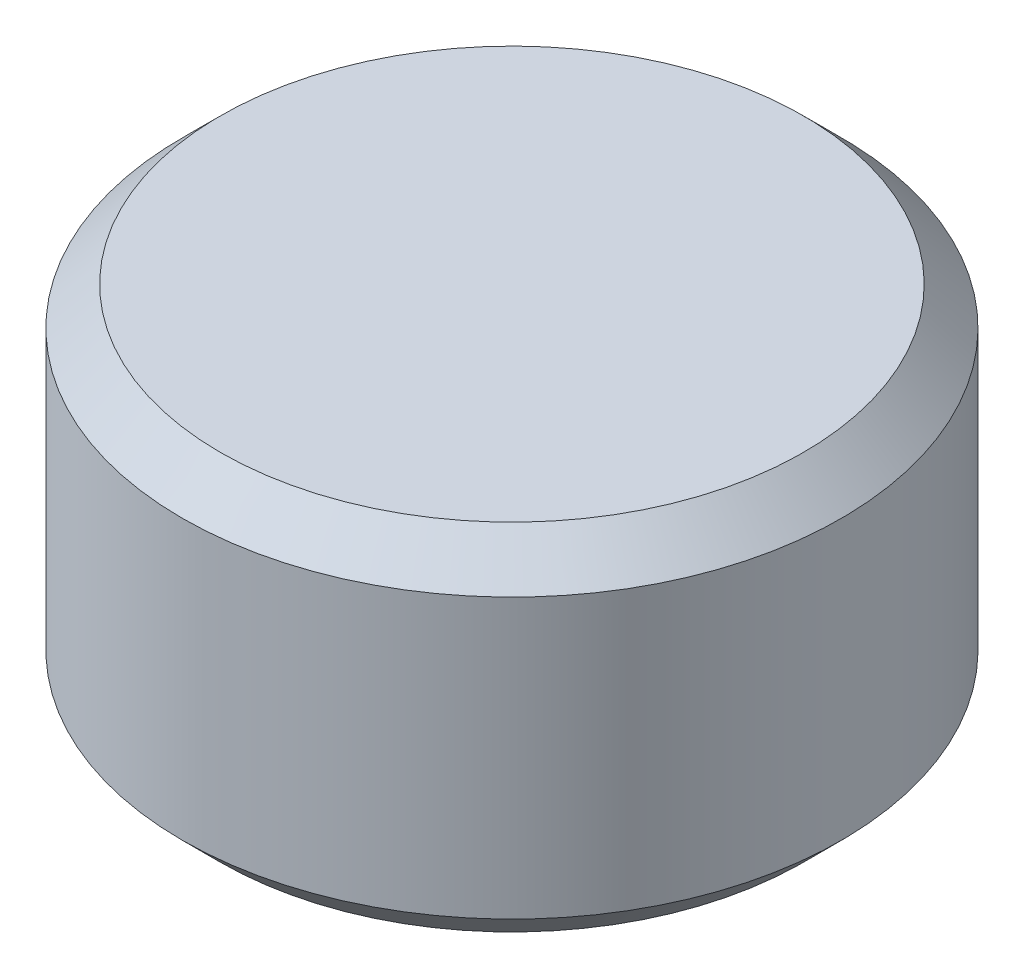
ISO-10303-21;
HEADER;
FILE_DESCRIPTION(('STEP AP214'),'2;1');
FILE_NAME('part.step','',(''),(''),'','','');
FILE_SCHEMA(('AUTOMOTIVE_DESIGN { 1 0 10303 214 1 1 1 1 }'));
ENDSEC;
DATA;
#1=APPLICATION_CONTEXT('core data for automotive mechanical design processes');
#2=APPLICATION_PROTOCOL_DEFINITION('international standard','automotive_design',2000,#1);
#3=PRODUCT_CONTEXT('',#1,'mechanical');
#4=PRODUCT('Part','Part','',(#3));
#5=PRODUCT_RELATED_PRODUCT_CATEGORY('part','',(#4));
#6=PRODUCT_DEFINITION_FORMATION('','',#4);
#7=PRODUCT_DEFINITION_CONTEXT('part definition',#1,'design');
#8=PRODUCT_DEFINITION('design','',#6,#7);
#9=PRODUCT_DEFINITION_SHAPE('','',#8);
#10=(LENGTH_UNIT() NAMED_UNIT(*) SI_UNIT(.MILLI.,.METRE.));
#11=(NAMED_UNIT(*) PLANE_ANGLE_UNIT() SI_UNIT($,.RADIAN.));
#12=(NAMED_UNIT(*) SI_UNIT($,.STERADIAN.) SOLID_ANGLE_UNIT());
#13=UNCERTAINTY_MEASURE_WITH_UNIT(LENGTH_MEASURE(1.E-05),#10,'distance_accuracy_value','');
#14=(GEOMETRIC_REPRESENTATION_CONTEXT(3) GLOBAL_UNCERTAINTY_ASSIGNED_CONTEXT((#13)) GLOBAL_UNIT_ASSIGNED_CONTEXT((#10,
#11,#12)) REPRESENTATION_CONTEXT('',''));
#15=CARTESIAN_POINT('',(0.,0.,0.));
#16=DIRECTION('',(0.,0.,1.));
#17=DIRECTION('',(1.,0.,0.));
#18=AXIS2_PLACEMENT_3D('',#15,#16,#17);
#19=CARTESIAN_POINT('',(0.,14.,0.));
#20=DIRECTION('',(0.,-1.,0.));
#21=DIRECTION('',(0.,0.,-1.));
#22=AXIS2_PLACEMENT_3D('',#19,#20,#21);
#23=CYLINDRICAL_SURFACE('',#22,13.);
#24=CARTESIAN_POINT('',(0.,1.5,0.));
#25=DIRECTION('',(0.,1.,0.));
#26=DIRECTION('',(0.,0.,1.));
#27=AXIS2_PLACEMENT_3D('',#24,#25,#26);
#28=CIRCLE('',#27,13.);
#29=CARTESIAN_POINT('',(0.,1.5,13.));
#30=VERTEX_POINT('',#29);
#31=EDGE_CURVE('E44',#30,#30,#28,.T.);
#32=ORIENTED_EDGE('',*,*,#31,.T.);
#33=EDGE_LOOP('',(#32));
#34=FACE_BOUND('',#33,.T.);
#35=CARTESIAN_POINT('',(0.,12.5,0.));
#36=DIRECTION('',(0.,1.,0.));
#37=DIRECTION('',(0.,0.,1.));
#38=AXIS2_PLACEMENT_3D('',#35,#36,#37);
#39=CIRCLE('',#38,13.);
#40=CARTESIAN_POINT('',(0.,12.5,13.));
#41=VERTEX_POINT('',#40);
#42=EDGE_CURVE('E48',#41,#41,#39,.F.);
#43=ORIENTED_EDGE('',*,*,#42,.T.);
#44=EDGE_LOOP('',(#43));
#45=FACE_BOUND('',#44,.T.);
#46=ADVANCED_FACE('F33',(#34,#45),#23,.T.);
#47=CARTESIAN_POINT('',(0.,14.,0.));
#48=DIRECTION('',(0.,1.,0.));
#49=DIRECTION('',(0.,0.,1.));
#50=AXIS2_PLACEMENT_3D('',#47,#48,#49);
#51=PLANE('',#50);
#52=CARTESIAN_POINT('',(0.,14.,0.));
#53=DIRECTION('',(0.,1.,0.));
#54=DIRECTION('',(0.,0.,1.));
#55=AXIS2_PLACEMENT_3D('',#52,#53,#54);
#56=CIRCLE('',#55,11.5);
#57=CARTESIAN_POINT('',(0.,14.,11.5));
#58=VERTEX_POINT('',#57);
#59=EDGE_CURVE('E10',#58,#58,#56,.T.);
#60=ORIENTED_EDGE('',*,*,#59,.T.);
#61=EDGE_LOOP('',(#60));
#62=FACE_BOUND('',#61,.T.);
#63=ADVANCED_FACE('F64',(#62),#51,.T.);
#64=CARTESIAN_POINT('',(0.,0.,0.));
#65=DIRECTION('',(0.,1.,0.));
#66=DIRECTION('',(0.,0.,1.));
#67=AXIS2_PLACEMENT_3D('',#64,#65,#66);
#68=PLANE('',#67);
#69=CARTESIAN_POINT('',(0.,0.,0.));
#70=DIRECTION('',(0.,1.,0.));
#71=DIRECTION('',(0.,0.,1.));
#72=AXIS2_PLACEMENT_3D('',#69,#70,#71);
#73=CIRCLE('',#72,11.5);
#74=CARTESIAN_POINT('',(0.,0.,11.5));
#75=VERTEX_POINT('',#74);
#76=EDGE_CURVE('E40',#75,#75,#73,.F.);
#77=ORIENTED_EDGE('',*,*,#76,.T.);
#78=EDGE_LOOP('',(#77));
#79=FACE_BOUND('',#78,.T.);
#80=ADVANCED_FACE('F61',(#79),#68,.F.);
#81=CARTESIAN_POINT('',(0.,1.5,0.));
#82=DIRECTION('',(0.,1.,0.));
#83=DIRECTION('',(0.,0.,1.));
#84=AXIS2_PLACEMENT_3D('',#81,#82,#83);
#85=CONICAL_SURFACE('',#84,13.,0.785398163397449);
#86=ORIENTED_EDGE('',*,*,#76,.F.);
#87=EDGE_LOOP('',(#86));
#88=FACE_BOUND('',#87,.T.);
#89=ORIENTED_EDGE('',*,*,#31,.F.);
#90=EDGE_LOOP('',(#89));
#91=FACE_BOUND('',#90,.T.);
#92=ADVANCED_FACE('F57',(#88,#91),#85,.T.);
#93=CARTESIAN_POINT('',(0.,14.,0.));
#94=DIRECTION('',(0.,-1.,0.));
#95=DIRECTION('',(0.,0.,-1.));
#96=AXIS2_PLACEMENT_3D('',#93,#94,#95);
#97=CONICAL_SURFACE('',#96,11.5,0.785398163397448);
#98=ORIENTED_EDGE('',*,*,#42,.F.);
#99=EDGE_LOOP('',(#98));
#100=FACE_BOUND('',#99,.T.);
#101=ORIENTED_EDGE('',*,*,#59,.F.);
#102=EDGE_LOOP('',(#101));
#103=FACE_BOUND('',#102,.T.);
#104=ADVANCED_FACE('F35',(#100,#103),#97,.T.);
#105=CLOSED_SHELL('',(#46,#63,#80,#92,#104));
#106=MANIFOLD_SOLID_BREP('B2',#105);
#107=ADVANCED_BREP_SHAPE_REPRESENTATION('',(#18,#106),#14);
#108=SHAPE_DEFINITION_REPRESENTATION(#9,#107);
ENDSEC;
END-ISO-10303-21;
